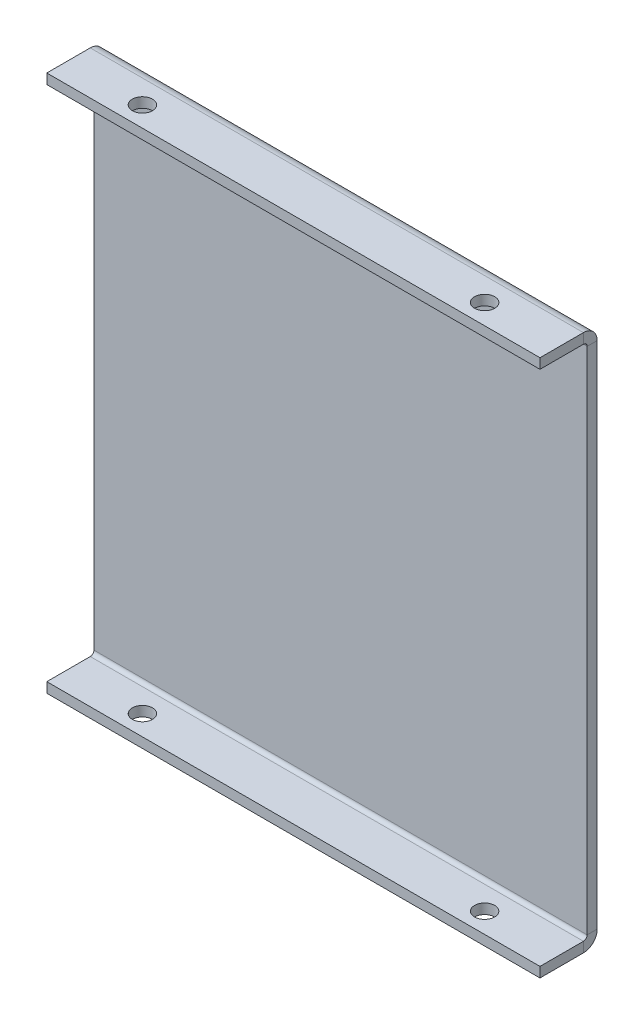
ISO-10303-21;
HEADER;
FILE_DESCRIPTION(('STEP AP214'),'2;1');
FILE_NAME('part.step','',(''),(''),'','','');
FILE_SCHEMA(('AUTOMOTIVE_DESIGN { 1 0 10303 214 1 1 1 1 }'));
ENDSEC;
DATA;
#1=APPLICATION_CONTEXT('core data for automotive mechanical design processes');
#2=APPLICATION_PROTOCOL_DEFINITION('international standard','automotive_design',2000,#1);
#3=PRODUCT_CONTEXT('',#1,'mechanical');
#4=PRODUCT('Part','Part','',(#3));
#5=PRODUCT_RELATED_PRODUCT_CATEGORY('part','',(#4));
#6=PRODUCT_DEFINITION_FORMATION('','',#4);
#7=PRODUCT_DEFINITION_CONTEXT('part definition',#1,'design');
#8=PRODUCT_DEFINITION('design','',#6,#7);
#9=PRODUCT_DEFINITION_SHAPE('','',#8);
#10=(LENGTH_UNIT() NAMED_UNIT(*) SI_UNIT(.MILLI.,.METRE.));
#11=(NAMED_UNIT(*) PLANE_ANGLE_UNIT() SI_UNIT($,.RADIAN.));
#12=(NAMED_UNIT(*) SI_UNIT($,.STERADIAN.) SOLID_ANGLE_UNIT());
#13=UNCERTAINTY_MEASURE_WITH_UNIT(LENGTH_MEASURE(1.E-05),#10,'distance_accuracy_value','');
#14=(GEOMETRIC_REPRESENTATION_CONTEXT(3) GLOBAL_UNCERTAINTY_ASSIGNED_CONTEXT((#13)) GLOBAL_UNIT_ASSIGNED_CONTEXT((#10,
#11,#12)) REPRESENTATION_CONTEXT('',''));
#15=CARTESIAN_POINT('',(0.,0.,0.));
#16=DIRECTION('',(0.,0.,1.));
#17=DIRECTION('',(1.,0.,0.));
#18=AXIS2_PLACEMENT_3D('',#15,#16,#17);
#19=CARTESIAN_POINT('',(-49.,62.,-2.));
#20=DIRECTION('',(0.,0.,1.));
#21=DIRECTION('',(1.,0.,0.));
#22=AXIS2_PLACEMENT_3D('',#19,#20,#21);
#23=PLANE('',#22);
#24=DIRECTION('',(0.,1.,0.));
#25=VECTOR('',#24,1.);
#26=CARTESIAN_POINT('',(49.,62.,-2.));
#27=LINE('',#26,#25);
#28=CARTESIAN_POINT('',(49.,-50.636077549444,-2.));
#29=VERTEX_POINT('',#28);
#30=CARTESIAN_POINT('',(49.,50.636077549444,-2.00000001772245));
#31=VERTEX_POINT('',#30);
#32=EDGE_CURVE('E54',#29,#31,#27,.T.);
#33=ORIENTED_EDGE('',*,*,#32,.F.);
#34=DIRECTION('',(-1.,0.,0.));
#35=VECTOR('',#34,1.);
#36=CARTESIAN_POINT('',(-49.,-50.636077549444,-2.));
#37=LINE('',#36,#35);
#38=CARTESIAN_POINT('',(-49.,-50.636077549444,-2.00000001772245));
#39=VERTEX_POINT('',#38);
#40=EDGE_CURVE('E256',#29,#39,#37,.T.);
#41=ORIENTED_EDGE('',*,*,#40,.T.);
#42=DIRECTION('',(0.,-1.,0.));
#43=VECTOR('',#42,1.);
#44=CARTESIAN_POINT('',(-49.,62.,-2.));
#45=LINE('',#44,#43);
#46=CARTESIAN_POINT('',(-49.,50.636077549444,-2.0000000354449));
#47=VERTEX_POINT('',#46);
#48=EDGE_CURVE('E264',#47,#39,#45,.T.);
#49=ORIENTED_EDGE('',*,*,#48,.F.);
#50=DIRECTION('',(-1.,0.,0.));
#51=VECTOR('',#50,1.);
#52=CARTESIAN_POINT('',(-49.,50.636077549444,-2.));
#53=LINE('',#52,#51);
#54=EDGE_CURVE('E247',#31,#47,#53,.T.);
#55=ORIENTED_EDGE('',*,*,#54,.F.);
#56=EDGE_LOOP('',(#33,#41,#49,#55));
#57=FACE_BOUND('',#56,.T.);
#58=ADVANCED_FACE('F50',(#57),#23,.F.);
#59=CARTESIAN_POINT('',(-49.,62.,-2.));
#60=DIRECTION('',(-1.,0.,0.));
#61=DIRECTION('',(0.,-1.,0.));
#62=AXIS2_PLACEMENT_3D('',#59,#60,#61);
#63=PLANE('',#62);
#64=DIRECTION('',(0.,0.,-1.));
#65=VECTOR('',#64,1.);
#66=CARTESIAN_POINT('',(-49.,-50.636077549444,-2.00000000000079));
#67=LINE('',#66,#65);
#68=CARTESIAN_POINT('',(-49.,-50.636077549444,0.));
#69=VERTEX_POINT('',#68);
#70=EDGE_CURVE('E12',#69,#39,#67,.T.);
#71=ORIENTED_EDGE('',*,*,#70,.F.);
#72=DIRECTION('',(0.,-1.,0.));
#73=VECTOR('',#72,1.);
#74=CARTESIAN_POINT('',(-49.,62.,0.));
#75=LINE('',#74,#73);
#76=CARTESIAN_POINT('',(-49.,50.636077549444,-3.54449022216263E-08));
#77=VERTEX_POINT('',#76);
#78=EDGE_CURVE('E67',#77,#69,#75,.T.);
#79=ORIENTED_EDGE('',*,*,#78,.F.);
#80=DIRECTION('',(0.,0.,-1.));
#81=VECTOR('',#80,1.);
#82=CARTESIAN_POINT('',(-49.,50.636077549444,-2.00000000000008));
#83=LINE('',#82,#81);
#84=EDGE_CURVE('E249',#77,#47,#83,.T.);
#85=ORIENTED_EDGE('',*,*,#84,.T.);
#86=ORIENTED_EDGE('',*,*,#48,.T.);
#87=EDGE_LOOP('',(#71,#79,#85,#86));
#88=FACE_BOUND('',#87,.T.);
#89=ADVANCED_FACE('F52',(#88),#63,.T.);
#90=CARTESIAN_POINT('',(49.,62.,-2.));
#91=DIRECTION('',(1.,0.,0.));
#92=DIRECTION('',(0.,1.,0.));
#93=AXIS2_PLACEMENT_3D('',#90,#91,#92);
#94=PLANE('',#93);
#95=DIRECTION('',(0.,0.,1.));
#96=VECTOR('',#95,1.);
#97=CARTESIAN_POINT('',(49.,-50.636077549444,-2.00000000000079));
#98=LINE('',#97,#96);
#99=CARTESIAN_POINT('',(49.,-50.636077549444,0.));
#100=VERTEX_POINT('',#99);
#101=EDGE_CURVE('E259',#29,#100,#98,.T.);
#102=ORIENTED_EDGE('',*,*,#101,.F.);
#103=ORIENTED_EDGE('',*,*,#32,.T.);
#104=DIRECTION('',(0.,0.,1.));
#105=VECTOR('',#104,1.);
#106=CARTESIAN_POINT('',(49.,50.636077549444,-2.00000000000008));
#107=LINE('',#106,#105);
#108=CARTESIAN_POINT('',(49.,50.636077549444,0.));
#109=VERTEX_POINT('',#108);
#110=EDGE_CURVE('E254',#31,#109,#107,.T.);
#111=ORIENTED_EDGE('',*,*,#110,.T.);
#112=DIRECTION('',(0.,1.,0.));
#113=VECTOR('',#112,1.);
#114=CARTESIAN_POINT('',(49.,62.,0.));
#115=LINE('',#114,#113);
#116=EDGE_CURVE('E75',#100,#109,#115,.T.);
#117=ORIENTED_EDGE('',*,*,#116,.F.);
#118=EDGE_LOOP('',(#102,#103,#111,#117));
#119=FACE_BOUND('',#118,.T.);
#120=ADVANCED_FACE('F269',(#119),#94,.T.);
#121=CARTESIAN_POINT('',(-49.,62.,0.));
#122=DIRECTION('',(0.,0.,1.));
#123=DIRECTION('',(1.,0.,0.));
#124=AXIS2_PLACEMENT_3D('',#121,#122,#123);
#125=PLANE('',#124);
#126=DIRECTION('',(-1.,0.,0.));
#127=VECTOR('',#126,1.);
#128=CARTESIAN_POINT('',(-49.,-50.636077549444,0.));
#129=LINE('',#128,#127);
#130=EDGE_CURVE('E59',#100,#69,#129,.T.);
#131=ORIENTED_EDGE('',*,*,#130,.F.);
#132=ORIENTED_EDGE('',*,*,#116,.T.);
#133=DIRECTION('',(-1.,0.,0.));
#134=VECTOR('',#133,1.);
#135=CARTESIAN_POINT('',(-49.,50.636077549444,0.));
#136=LINE('',#135,#134);
#137=EDGE_CURVE('E252',#109,#77,#136,.T.);
#138=ORIENTED_EDGE('',*,*,#137,.T.);
#139=ORIENTED_EDGE('',*,*,#78,.T.);
#140=EDGE_LOOP('',(#131,#132,#138,#139));
#141=FACE_BOUND('',#140,.T.);
#142=ADVANCED_FACE('F266',(#141),#125,.T.);
#143=CARTESIAN_POINT('',(49.,50.636077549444,0.736600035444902));
#144=DIRECTION('',(1.,0.,0.));
#145=DIRECTION('',(0.,0.,-1.));
#146=AXIS2_PLACEMENT_3D('',#143,#144,#145);
#147=PLANE('',#146);
#148=DIRECTION('',(0.,-1.,0.));
#149=VECTOR('',#148,1.);
#150=CARTESIAN_POINT('',(49.,53.3726775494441,0.736600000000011));
#151=LINE('',#150,#149);
#152=CARTESIAN_POINT('',(49.,53.372677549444,0.736600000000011));
#153=VERTEX_POINT('',#152);
#154=CARTESIAN_POINT('',(49.,51.372677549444,0.73659999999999));
#155=VERTEX_POINT('',#154);
#156=EDGE_CURVE('E193',#153,#155,#151,.T.);
#157=ORIENTED_EDGE('',*,*,#156,.T.);
#158=CARTESIAN_POINT('',(49.,50.636077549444,0.7366));
#159=DIRECTION('',(1.,0.,0.));
#160=DIRECTION('',(0.,0.,-1.));
#161=AXIS2_PLACEMENT_3D('',#158,#159,#160);
#162=CIRCLE('',#161,0.736600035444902);
#163=EDGE_CURVE('E197',#155,#109,#162,.F.);
#164=ORIENTED_EDGE('',*,*,#163,.T.);
#165=ORIENTED_EDGE('',*,*,#110,.F.);
#166=CARTESIAN_POINT('',(49.,50.636077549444,0.736600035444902));
#167=DIRECTION('',(-1.,0.,0.));
#168=DIRECTION('',(0.,0.,-1.));
#169=AXIS2_PLACEMENT_3D('',#166,#167,#168);
#170=CIRCLE('',#169,2.73660005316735);
#171=EDGE_CURVE('E240',#153,#31,#170,.T.);
#172=ORIENTED_EDGE('',*,*,#171,.F.);
#173=EDGE_LOOP('',(#157,#164,#165,#172));
#174=FACE_BOUND('',#173,.T.);
#175=ADVANCED_FACE('F273',(#174),#147,.T.);
#176=CARTESIAN_POINT('',(-49.,50.636077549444,0.736600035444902));
#177=DIRECTION('',(-1.,0.,0.));
#178=DIRECTION('',(0.,0.,1.));
#179=AXIS2_PLACEMENT_3D('',#176,#177,#178);
#180=PLANE('',#179);
#181=ORIENTED_EDGE('',*,*,#84,.F.);
#182=CARTESIAN_POINT('',(-49.,50.636077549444,0.7366));
#183=DIRECTION('',(1.,0.,0.));
#184=DIRECTION('',(0.,0.,-1.));
#185=AXIS2_PLACEMENT_3D('',#182,#183,#184);
#186=CIRCLE('',#185,0.736600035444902);
#187=CARTESIAN_POINT('',(-49.,51.372677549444,0.73659999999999));
#188=VERTEX_POINT('',#187);
#189=EDGE_CURVE('E237',#77,#188,#186,.T.);
#190=ORIENTED_EDGE('',*,*,#189,.T.);
#191=DIRECTION('',(0.,1.,0.));
#192=VECTOR('',#191,1.);
#193=CARTESIAN_POINT('',(-49.,53.3726775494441,0.736600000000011));
#194=LINE('',#193,#192);
#195=CARTESIAN_POINT('',(-49.,53.3726776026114,0.736600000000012));
#196=VERTEX_POINT('',#195);
#197=EDGE_CURVE('E229',#188,#196,#194,.T.);
#198=ORIENTED_EDGE('',*,*,#197,.T.);
#199=CARTESIAN_POINT('',(-49.,50.636077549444,0.736600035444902));
#200=DIRECTION('',(1.,0.,0.));
#201=DIRECTION('',(0.,0.,1.));
#202=AXIS2_PLACEMENT_3D('',#199,#200,#201);
#203=CIRCLE('',#202,2.73660005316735);
#204=EDGE_CURVE('E244',#47,#196,#203,.T.);
#205=ORIENTED_EDGE('',*,*,#204,.F.);
#206=EDGE_LOOP('',(#181,#190,#198,#205));
#207=FACE_BOUND('',#206,.T.);
#208=ADVANCED_FACE('F286',(#207),#180,.T.);
#209=CARTESIAN_POINT('',(-98.0583557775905,50.636077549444,0.7366));
#210=DIRECTION('',(1.,0.,0.));
#211=DIRECTION('',(0.,0.,-1.));
#212=AXIS2_PLACEMENT_3D('',#209,#210,#211);
#213=CYLINDRICAL_SURFACE('',#212,2.7366000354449);
#214=ORIENTED_EDGE('',*,*,#204,.T.);
#215=DIRECTION('',(-1.,0.,0.));
#216=VECTOR('',#215,1.);
#217=CARTESIAN_POINT('',(-49.,53.372677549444,0.736600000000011));
#218=LINE('',#217,#216);
#219=EDGE_CURVE('E209',#153,#196,#218,.T.);
#220=ORIENTED_EDGE('',*,*,#219,.F.);
#221=ORIENTED_EDGE('',*,*,#171,.T.);
#222=ORIENTED_EDGE('',*,*,#54,.T.);
#223=EDGE_LOOP('',(#214,#220,#221,#222));
#224=FACE_BOUND('',#223,.T.);
#225=ADVANCED_FACE('F277',(#224),#213,.T.);
#226=CARTESIAN_POINT('',(-98.0583557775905,50.636077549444,0.7366));
#227=DIRECTION('',(1.,0.,0.));
#228=DIRECTION('',(0.,0.,-1.));
#229=AXIS2_PLACEMENT_3D('',#226,#227,#228);
#230=CYLINDRICAL_SURFACE('',#229,0.736600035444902);
#231=ORIENTED_EDGE('',*,*,#189,.F.);
#232=ORIENTED_EDGE('',*,*,#137,.F.);
#233=ORIENTED_EDGE('',*,*,#163,.F.);
#234=DIRECTION('',(-1.,0.,0.));
#235=VECTOR('',#234,1.);
#236=CARTESIAN_POINT('',(-49.,51.372677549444,0.73659999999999));
#237=LINE('',#236,#235);
#238=EDGE_CURVE('E232',#155,#188,#237,.T.);
#239=ORIENTED_EDGE('',*,*,#238,.T.);
#240=EDGE_LOOP('',(#231,#232,#233,#239));
#241=FACE_BOUND('',#240,.T.);
#242=ADVANCED_FACE('F300',(#241),#230,.F.);
#243=CARTESIAN_POINT('',(-49.,53.372677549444,9.37267754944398));
#244=DIRECTION('',(0.,0.,1.));
#245=DIRECTION('',(-1.,0.,0.));
#246=AXIS2_PLACEMENT_3D('',#243,#244,#245);
#247=PLANE('',#246);
#248=DIRECTION('',(-1.,0.,0.));
#249=VECTOR('',#248,1.);
#250=CARTESIAN_POINT('',(-49.,51.372677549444,9.37267754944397));
#251=LINE('',#250,#249);
#252=CARTESIAN_POINT('',(49.,51.372677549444,9.37267754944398));
#253=VERTEX_POINT('',#252);
#254=CARTESIAN_POINT('',(-49.,51.372677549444,9.37267754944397));
#255=VERTEX_POINT('',#254);
#256=EDGE_CURVE('E202',#253,#255,#251,.T.);
#257=ORIENTED_EDGE('',*,*,#256,.F.);
#258=DIRECTION('',(0.,-1.,0.));
#259=VECTOR('',#258,1.);
#260=CARTESIAN_POINT('',(49.,53.372677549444,9.37267754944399));
#261=LINE('',#260,#259);
#262=CARTESIAN_POINT('',(49.,53.372677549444,9.37267754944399));
#263=VERTEX_POINT('',#262);
#264=EDGE_CURVE('E194',#263,#253,#261,.T.);
#265=ORIENTED_EDGE('',*,*,#264,.F.);
#266=DIRECTION('',(-1.,0.,0.));
#267=VECTOR('',#266,1.);
#268=CARTESIAN_POINT('',(-49.,53.372677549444,9.37267754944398));
#269=LINE('',#268,#267);
#270=CARTESIAN_POINT('',(-49.,53.372677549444,9.37267754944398));
#271=VERTEX_POINT('',#270);
#272=EDGE_CURVE('E226',#263,#271,#269,.T.);
#273=ORIENTED_EDGE('',*,*,#272,.T.);
#274=DIRECTION('',(0.,-1.,0.));
#275=VECTOR('',#274,1.);
#276=CARTESIAN_POINT('',(-49.,53.372677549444,9.37267754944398));
#277=LINE('',#276,#275);
#278=EDGE_CURVE('E224',#271,#255,#277,.T.);
#279=ORIENTED_EDGE('',*,*,#278,.T.);
#280=EDGE_LOOP('',(#257,#265,#273,#279));
#281=FACE_BOUND('',#280,.T.);
#282=ADVANCED_FACE('F294',(#281),#247,.T.);
#283=CARTESIAN_POINT('',(34.,53.372677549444,5.372677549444));
#284=DIRECTION('',(0.,-1.,0.));
#285=DIRECTION('',(1.,0.,0.));
#286=AXIS2_PLACEMENT_3D('',#283,#284,#285);
#287=CYLINDRICAL_SURFACE('',#286,2.);
#288=CARTESIAN_POINT('',(34.,53.372677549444,5.372677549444));
#289=DIRECTION('',(0.,-1.,0.));
#290=DIRECTION('',(1.,0.,0.));
#291=AXIS2_PLACEMENT_3D('',#288,#289,#290);
#292=CIRCLE('',#291,2.);
#293=CARTESIAN_POINT('',(36.,53.372677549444,5.372677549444));
#294=VERTEX_POINT('',#293);
#295=EDGE_CURVE('E212',#294,#294,#292,.T.);
#296=ORIENTED_EDGE('',*,*,#295,.F.);
#297=EDGE_LOOP('',(#296));
#298=FACE_BOUND('',#297,.T.);
#299=CARTESIAN_POINT('',(34.,51.372677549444,5.37267754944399));
#300=DIRECTION('',(0.,-1.,0.));
#301=DIRECTION('',(1.,0.,0.));
#302=AXIS2_PLACEMENT_3D('',#299,#300,#301);
#303=CIRCLE('',#302,2.);
#304=CARTESIAN_POINT('',(36.,51.372677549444,5.37267754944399));
#305=VERTEX_POINT('',#304);
#306=EDGE_CURVE('E221',#305,#305,#303,.T.);
#307=ORIENTED_EDGE('',*,*,#306,.T.);
#308=EDGE_LOOP('',(#307));
#309=FACE_BOUND('',#308,.T.);
#310=ADVANCED_FACE('F359',(#298,#309),#287,.F.);
#311=CARTESIAN_POINT('',(-34.,53.372677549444,5.37267754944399));
#312=DIRECTION('',(0.,-1.,0.));
#313=DIRECTION('',(1.,0.,0.));
#314=AXIS2_PLACEMENT_3D('',#311,#312,#313);
#315=CYLINDRICAL_SURFACE('',#314,2.);
#316=CARTESIAN_POINT('',(-34.,53.372677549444,5.37267754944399));
#317=DIRECTION('',(0.,-1.,0.));
#318=DIRECTION('',(1.,0.,0.));
#319=AXIS2_PLACEMENT_3D('',#316,#317,#318);
#320=CIRCLE('',#319,2.);
#321=CARTESIAN_POINT('',(-32.,53.372677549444,5.37267754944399));
#322=VERTEX_POINT('',#321);
#323=EDGE_CURVE('E215',#322,#322,#320,.T.);
#324=ORIENTED_EDGE('',*,*,#323,.F.);
#325=EDGE_LOOP('',(#324));
#326=FACE_BOUND('',#325,.T.);
#327=CARTESIAN_POINT('',(-34.,51.372677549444,5.37267754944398));
#328=DIRECTION('',(0.,-1.,0.));
#329=DIRECTION('',(1.,0.,0.));
#330=AXIS2_PLACEMENT_3D('',#327,#328,#329);
#331=CIRCLE('',#330,2.);
#332=CARTESIAN_POINT('',(-32.,51.372677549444,5.37267754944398));
#333=VERTEX_POINT('',#332);
#334=EDGE_CURVE('E218',#333,#333,#331,.T.);
#335=ORIENTED_EDGE('',*,*,#334,.T.);
#336=EDGE_LOOP('',(#335));
#337=FACE_BOUND('',#336,.T.);
#338=ADVANCED_FACE('F355',(#326,#337),#315,.F.);
#339=CARTESIAN_POINT('',(-49.,53.372677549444,9.37267754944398));
#340=DIRECTION('',(0.,-1.,0.));
#341=DIRECTION('',(1.,0.,0.));
#342=AXIS2_PLACEMENT_3D('',#339,#340,#341);
#343=PLANE('',#342);
#344=ORIENTED_EDGE('',*,*,#323,.T.);
#345=EDGE_LOOP('',(#344));
#346=FACE_BOUND('',#345,.T.);
#347=ORIENTED_EDGE('',*,*,#295,.T.);
#348=EDGE_LOOP('',(#347));
#349=FACE_BOUND('',#348,.T.);
#350=DIRECTION('',(0.,0.,1.));
#351=VECTOR('',#350,1.);
#352=CARTESIAN_POINT('',(49.,53.372677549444,9.37267754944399));
#353=LINE('',#352,#351);
#354=EDGE_CURVE('E198',#153,#263,#353,.T.);
#355=ORIENTED_EDGE('',*,*,#354,.F.);
#356=ORIENTED_EDGE('',*,*,#219,.T.);
#357=DIRECTION('',(0.,0.,-1.));
#358=VECTOR('',#357,1.);
#359=CARTESIAN_POINT('',(-49.,53.372677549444,9.37267754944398));
#360=LINE('',#359,#358);
#361=EDGE_CURVE('E207',#271,#196,#360,.T.);
#362=ORIENTED_EDGE('',*,*,#361,.F.);
#363=ORIENTED_EDGE('',*,*,#272,.F.);
#364=EDGE_LOOP('',(#355,#356,#362,#363));
#365=FACE_BOUND('',#364,.T.);
#366=ADVANCED_FACE('F281',(#346,#349,#365),#343,.F.);
#367=CARTESIAN_POINT('',(-49.,53.372677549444,9.37267754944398));
#368=DIRECTION('',(-1.,0.,0.));
#369=DIRECTION('',(0.,0.,-1.));
#370=AXIS2_PLACEMENT_3D('',#367,#368,#369);
#371=PLANE('',#370);
#372=ORIENTED_EDGE('',*,*,#197,.F.);
#373=DIRECTION('',(0.,0.,-1.));
#374=VECTOR('',#373,1.);
#375=CARTESIAN_POINT('',(-49.,51.372677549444,9.37267754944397));
#376=LINE('',#375,#374);
#377=EDGE_CURVE('E200',#255,#188,#376,.T.);
#378=ORIENTED_EDGE('',*,*,#377,.F.);
#379=ORIENTED_EDGE('',*,*,#278,.F.);
#380=ORIENTED_EDGE('',*,*,#361,.T.);
#381=EDGE_LOOP('',(#372,#378,#379,#380));
#382=FACE_BOUND('',#381,.T.);
#383=ADVANCED_FACE('F291',(#382),#371,.T.);
#384=CARTESIAN_POINT('',(-49.,51.372677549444,9.37267754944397));
#385=DIRECTION('',(0.,-1.,0.));
#386=DIRECTION('',(1.,0.,0.));
#387=AXIS2_PLACEMENT_3D('',#384,#385,#386);
#388=PLANE('',#387);
#389=ORIENTED_EDGE('',*,*,#238,.F.);
#390=DIRECTION('',(0.,0.,1.));
#391=VECTOR('',#390,1.);
#392=CARTESIAN_POINT('',(49.,51.372677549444,9.37267754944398));
#393=LINE('',#392,#391);
#394=EDGE_CURVE('E205',#155,#253,#393,.T.);
#395=ORIENTED_EDGE('',*,*,#394,.T.);
#396=ORIENTED_EDGE('',*,*,#256,.T.);
#397=ORIENTED_EDGE('',*,*,#377,.T.);
#398=EDGE_LOOP('',(#389,#395,#396,#397));
#399=FACE_BOUND('',#398,.T.);
#400=ORIENTED_EDGE('',*,*,#306,.F.);
#401=EDGE_LOOP('',(#400));
#402=FACE_BOUND('',#401,.T.);
#403=ORIENTED_EDGE('',*,*,#334,.F.);
#404=EDGE_LOOP('',(#403));
#405=FACE_BOUND('',#404,.T.);
#406=ADVANCED_FACE('F347',(#399,#402,#405),#388,.T.);
#407=CARTESIAN_POINT('',(49.,53.372677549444,9.37267754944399));
#408=DIRECTION('',(1.,0.,0.));
#409=DIRECTION('',(0.,0.,1.));
#410=AXIS2_PLACEMENT_3D('',#407,#408,#409);
#411=PLANE('',#410);
#412=ORIENTED_EDGE('',*,*,#156,.F.);
#413=ORIENTED_EDGE('',*,*,#354,.T.);
#414=ORIENTED_EDGE('',*,*,#264,.T.);
#415=ORIENTED_EDGE('',*,*,#394,.F.);
#416=EDGE_LOOP('',(#412,#413,#414,#415));
#417=FACE_BOUND('',#416,.T.);
#418=ADVANCED_FACE('F297',(#417),#411,.T.);
#419=CARTESIAN_POINT('',(49.,-50.636077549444,0.736600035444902));
#420=DIRECTION('',(1.,0.,0.));
#421=DIRECTION('',(0.,0.,-1.));
#422=AXIS2_PLACEMENT_3D('',#419,#420,#421);
#423=PLANE('',#422);
#424=ORIENTED_EDGE('',*,*,#101,.T.);
#425=CARTESIAN_POINT('',(49.,-50.636077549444,0.7366));
#426=DIRECTION('',(-1.,0.,0.));
#427=DIRECTION('',(0.,0.,1.));
#428=AXIS2_PLACEMENT_3D('',#425,#426,#427);
#429=CIRCLE('',#428,0.736600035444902);
#430=CARTESIAN_POINT('',(49.,-51.372677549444,0.736600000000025));
#431=VERTEX_POINT('',#430);
#432=EDGE_CURVE('E161',#100,#431,#429,.T.);
#433=ORIENTED_EDGE('',*,*,#432,.T.);
#434=DIRECTION('',(0.,1.,0.));
#435=VECTOR('',#434,1.);
#436=CARTESIAN_POINT('',(49.,-53.3726775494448,0.736600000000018));
#437=LINE('',#436,#435);
#438=CARTESIAN_POINT('',(49.,-53.372677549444,0.736600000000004));
#439=VERTEX_POINT('',#438);
#440=EDGE_CURVE('E317',#439,#431,#437,.T.);
#441=ORIENTED_EDGE('',*,*,#440,.F.);
#442=CARTESIAN_POINT('',(49.,-50.636077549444,0.736600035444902));
#443=DIRECTION('',(-1.,0.,0.));
#444=DIRECTION('',(0.,0.,-1.));
#445=AXIS2_PLACEMENT_3D('',#442,#443,#444);
#446=CIRCLE('',#445,2.73660005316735);
#447=EDGE_CURVE('E185',#29,#439,#446,.T.);
#448=ORIENTED_EDGE('',*,*,#447,.F.);
#449=EDGE_LOOP('',(#424,#433,#441,#448));
#450=FACE_BOUND('',#449,.T.);
#451=ADVANCED_FACE('F314',(#450),#423,.T.);
#452=CARTESIAN_POINT('',(-49.,-50.636077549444,0.736600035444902));
#453=DIRECTION('',(-1.,0.,0.));
#454=DIRECTION('',(0.,0.,1.));
#455=AXIS2_PLACEMENT_3D('',#452,#453,#454);
#456=PLANE('',#455);
#457=DIRECTION('',(0.,-1.,0.));
#458=VECTOR('',#457,1.);
#459=CARTESIAN_POINT('',(-49.,-53.3726775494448,0.736600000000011));
#460=LINE('',#459,#458);
#461=CARTESIAN_POINT('',(-49.,-51.372677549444,0.736600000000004));
#462=VERTEX_POINT('',#461);
#463=CARTESIAN_POINT('',(-49.,-53.3726775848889,0.736600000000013));
#464=VERTEX_POINT('',#463);
#465=EDGE_CURVE('E150',#462,#464,#460,.T.);
#466=ORIENTED_EDGE('',*,*,#465,.F.);
#467=CARTESIAN_POINT('',(-49.,-50.636077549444,0.7366));
#468=DIRECTION('',(-1.,0.,0.));
#469=DIRECTION('',(0.,0.,1.));
#470=AXIS2_PLACEMENT_3D('',#467,#468,#469);
#471=CIRCLE('',#470,0.736600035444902);
#472=EDGE_CURVE('E182',#462,#69,#471,.F.);
#473=ORIENTED_EDGE('',*,*,#472,.T.);
#474=ORIENTED_EDGE('',*,*,#70,.T.);
#475=CARTESIAN_POINT('',(-49.,-50.636077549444,0.736600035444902));
#476=DIRECTION('',(1.,0.,0.));
#477=DIRECTION('',(0.,0.,1.));
#478=AXIS2_PLACEMENT_3D('',#475,#476,#477);
#479=CIRCLE('',#478,2.73660005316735);
#480=EDGE_CURVE('E190',#464,#39,#479,.T.);
#481=ORIENTED_EDGE('',*,*,#480,.F.);
#482=EDGE_LOOP('',(#466,#473,#474,#481));
#483=FACE_BOUND('',#482,.T.);
#484=ADVANCED_FACE('F305',(#483),#456,.T.);
#485=CARTESIAN_POINT('',(98.0583557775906,-50.636077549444,0.7366));
#486=DIRECTION('',(-1.,0.,0.));
#487=DIRECTION('',(0.,0.,1.));
#488=AXIS2_PLACEMENT_3D('',#485,#486,#487);
#489=CYLINDRICAL_SURFACE('',#488,2.7366000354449);
#490=ORIENTED_EDGE('',*,*,#480,.T.);
#491=ORIENTED_EDGE('',*,*,#40,.F.);
#492=ORIENTED_EDGE('',*,*,#447,.T.);
#493=DIRECTION('',(-1.,0.,0.));
#494=VECTOR('',#493,1.);
#495=CARTESIAN_POINT('',(-49.,-53.372677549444,0.736600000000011));
#496=LINE('',#495,#494);
#497=EDGE_CURVE('E180',#439,#464,#496,.T.);
#498=ORIENTED_EDGE('',*,*,#497,.T.);
#499=EDGE_LOOP('',(#490,#491,#492,#498));
#500=FACE_BOUND('',#499,.T.);
#501=ADVANCED_FACE('F320',(#500),#489,.T.);
#502=CARTESIAN_POINT('',(98.0583557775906,-50.636077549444,0.7366));
#503=DIRECTION('',(-1.,0.,0.));
#504=DIRECTION('',(0.,0.,1.));
#505=AXIS2_PLACEMENT_3D('',#502,#503,#504);
#506=CYLINDRICAL_SURFACE('',#505,0.736600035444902);
#507=ORIENTED_EDGE('',*,*,#472,.F.);
#508=DIRECTION('',(-1.,0.,0.));
#509=VECTOR('',#508,1.);
#510=CARTESIAN_POINT('',(-49.,-51.372677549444,0.736600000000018));
#511=LINE('',#510,#509);
#512=EDGE_CURVE('E311',#431,#462,#511,.T.);
#513=ORIENTED_EDGE('',*,*,#512,.F.);
#514=ORIENTED_EDGE('',*,*,#432,.F.);
#515=ORIENTED_EDGE('',*,*,#130,.T.);
#516=EDGE_LOOP('',(#507,#513,#514,#515));
#517=FACE_BOUND('',#516,.T.);
#518=ADVANCED_FACE('F309',(#517),#506,.F.);
#519=CARTESIAN_POINT('',(34.,-53.3726775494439,5.37267754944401));
#520=DIRECTION('',(0.,1.,0.));
#521=DIRECTION('',(1.,0.,0.));
#522=AXIS2_PLACEMENT_3D('',#519,#520,#521);
#523=CYLINDRICAL_SURFACE('',#522,2.);
#524=CARTESIAN_POINT('',(34.,-53.3726775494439,5.37267754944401));
#525=DIRECTION('',(0.,1.,0.));
#526=DIRECTION('',(1.,0.,0.));
#527=AXIS2_PLACEMENT_3D('',#524,#525,#526);
#528=CIRCLE('',#527,2.);
#529=CARTESIAN_POINT('',(36.,-53.3726775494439,5.37267754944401));
#530=VERTEX_POINT('',#529);
#531=EDGE_CURVE('E400',#530,#530,#528,.T.);
#532=ORIENTED_EDGE('',*,*,#531,.F.);
#533=EDGE_LOOP('',(#532));
#534=FACE_BOUND('',#533,.T.);
#535=CARTESIAN_POINT('',(34.,-51.3726775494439,5.372677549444));
#536=DIRECTION('',(0.,1.,0.));
#537=DIRECTION('',(1.,0.,0.));
#538=AXIS2_PLACEMENT_3D('',#535,#536,#537);
#539=CIRCLE('',#538,2.);
#540=CARTESIAN_POINT('',(36.,-51.3726775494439,5.372677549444));
#541=VERTEX_POINT('',#540);
#542=EDGE_CURVE('E174',#541,#541,#539,.T.);
#543=ORIENTED_EDGE('',*,*,#542,.T.);
#544=EDGE_LOOP('',(#543));
#545=FACE_BOUND('',#544,.T.);
#546=ADVANCED_FACE('F374',(#534,#545),#523,.F.);
#547=CARTESIAN_POINT('',(-34.,-53.3726775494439,5.37267754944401));
#548=DIRECTION('',(0.,1.,0.));
#549=DIRECTION('',(1.,0.,0.));
#550=AXIS2_PLACEMENT_3D('',#547,#548,#549);
#551=CYLINDRICAL_SURFACE('',#550,2.);
#552=CARTESIAN_POINT('',(-34.,-53.3726775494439,5.37267754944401));
#553=DIRECTION('',(0.,1.,0.));
#554=DIRECTION('',(1.,0.,0.));
#555=AXIS2_PLACEMENT_3D('',#552,#553,#554);
#556=CIRCLE('',#555,2.);
#557=CARTESIAN_POINT('',(-32.,-53.3726775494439,5.37267754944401));
#558=VERTEX_POINT('',#557);
#559=EDGE_CURVE('E171',#558,#558,#556,.T.);
#560=ORIENTED_EDGE('',*,*,#559,.F.);
#561=EDGE_LOOP('',(#560));
#562=FACE_BOUND('',#561,.T.);
#563=CARTESIAN_POINT('',(-34.,-51.3726775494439,5.372677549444));
#564=DIRECTION('',(0.,1.,0.));
#565=DIRECTION('',(1.,0.,0.));
#566=AXIS2_PLACEMENT_3D('',#563,#564,#565);
#567=CIRCLE('',#566,2.);
#568=CARTESIAN_POINT('',(-32.,-51.3726775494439,5.372677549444));
#569=VERTEX_POINT('',#568);
#570=EDGE_CURVE('E169',#569,#569,#567,.T.);
#571=ORIENTED_EDGE('',*,*,#570,.T.);
#572=EDGE_LOOP('',(#571));
#573=FACE_BOUND('',#572,.T.);
#574=ADVANCED_FACE('F389',(#562,#573),#551,.F.);
#575=CARTESIAN_POINT('',(-49.,-53.3726775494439,9.37267754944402));
#576=DIRECTION('',(0.,0.,1.));
#577=DIRECTION('',(1.,0.,0.));
#578=AXIS2_PLACEMENT_3D('',#575,#576,#577);
#579=PLANE('',#578);
#580=DIRECTION('',(1.,0.,0.));
#581=VECTOR('',#580,1.);
#582=CARTESIAN_POINT('',(-49.,-51.3726775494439,9.37267754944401));
#583=LINE('',#582,#581);
#584=CARTESIAN_POINT('',(-49.,-51.3726775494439,9.37267754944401));
#585=VERTEX_POINT('',#584);
#586=CARTESIAN_POINT('',(49.,-51.3726775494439,9.372677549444));
#587=VERTEX_POINT('',#586);
#588=EDGE_CURVE('E160',#585,#587,#583,.T.);
#589=ORIENTED_EDGE('',*,*,#588,.F.);
#590=DIRECTION('',(0.,1.,0.));
#591=VECTOR('',#590,1.);
#592=CARTESIAN_POINT('',(-49.,-53.3726775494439,9.37267754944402));
#593=LINE('',#592,#591);
#594=CARTESIAN_POINT('',(-49.,-53.3726775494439,9.37267754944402));
#595=VERTEX_POINT('',#594);
#596=EDGE_CURVE('E147',#595,#585,#593,.T.);
#597=ORIENTED_EDGE('',*,*,#596,.F.);
#598=DIRECTION('',(1.,0.,0.));
#599=VECTOR('',#598,1.);
#600=CARTESIAN_POINT('',(-49.,-53.3726775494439,9.37267754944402));
#601=LINE('',#600,#599);
#602=CARTESIAN_POINT('',(49.,-53.3726775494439,9.37267754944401));
#603=VERTEX_POINT('',#602);
#604=EDGE_CURVE('E158',#595,#603,#601,.T.);
#605=ORIENTED_EDGE('',*,*,#604,.T.);
#606=DIRECTION('',(0.,1.,0.));
#607=VECTOR('',#606,1.);
#608=CARTESIAN_POINT('',(49.,-53.3726775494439,9.37267754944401));
#609=LINE('',#608,#607);
#610=EDGE_CURVE('E168',#603,#587,#609,.T.);
#611=ORIENTED_EDGE('',*,*,#610,.T.);
#612=EDGE_LOOP('',(#589,#597,#605,#611));
#613=FACE_BOUND('',#612,.T.);
#614=ADVANCED_FACE('F157',(#613),#579,.T.);
#615=CARTESIAN_POINT('',(-49.,-53.3726775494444,-114.627322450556));
#616=DIRECTION('',(0.,1.,0.));
#617=DIRECTION('',(1.,0.,0.));
#618=AXIS2_PLACEMENT_3D('',#615,#616,#617);
#619=PLANE('',#618);
#620=ORIENTED_EDGE('',*,*,#497,.F.);
#621=DIRECTION('',(0.,0.,-1.));
#622=VECTOR('',#621,1.);
#623=CARTESIAN_POINT('',(49.,-53.3726775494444,-114.627322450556));
#624=LINE('',#623,#622);
#625=EDGE_CURVE('E167',#603,#439,#624,.T.);
#626=ORIENTED_EDGE('',*,*,#625,.F.);
#627=ORIENTED_EDGE('',*,*,#604,.F.);
#628=DIRECTION('',(0.,0.,1.));
#629=VECTOR('',#628,1.);
#630=CARTESIAN_POINT('',(-49.,-53.3726775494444,-114.627322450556));
#631=LINE('',#630,#629);
#632=EDGE_CURVE('E144',#464,#595,#631,.T.);
#633=ORIENTED_EDGE('',*,*,#632,.F.);
#634=EDGE_LOOP('',(#620,#626,#627,#633));
#635=FACE_BOUND('',#634,.T.);
#636=ORIENTED_EDGE('',*,*,#559,.T.);
#637=EDGE_LOOP('',(#636));
#638=FACE_BOUND('',#637,.T.);
#639=ORIENTED_EDGE('',*,*,#531,.T.);
#640=EDGE_LOOP('',(#639));
#641=FACE_BOUND('',#640,.T.);
#642=ADVANCED_FACE('F164',(#635,#638,#641),#619,.F.);
#643=CARTESIAN_POINT('',(49.,-53.3726775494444,-114.627322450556));
#644=DIRECTION('',(1.,0.,0.));
#645=DIRECTION('',(0.,0.,-1.));
#646=AXIS2_PLACEMENT_3D('',#643,#644,#645);
#647=PLANE('',#646);
#648=ORIENTED_EDGE('',*,*,#625,.T.);
#649=ORIENTED_EDGE('',*,*,#440,.T.);
#650=DIRECTION('',(0.,0.,-1.));
#651=VECTOR('',#650,1.);
#652=CARTESIAN_POINT('',(49.,-51.3726775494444,-114.627322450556));
#653=LINE('',#652,#651);
#654=EDGE_CURVE('E405',#587,#431,#653,.T.);
#655=ORIENTED_EDGE('',*,*,#654,.F.);
#656=ORIENTED_EDGE('',*,*,#610,.F.);
#657=EDGE_LOOP('',(#648,#649,#655,#656));
#658=FACE_BOUND('',#657,.T.);
#659=ADVANCED_FACE('F380',(#658),#647,.T.);
#660=CARTESIAN_POINT('',(-49.,-51.3726775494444,-114.627322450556));
#661=DIRECTION('',(0.,1.,0.));
#662=DIRECTION('',(1.,0.,0.));
#663=AXIS2_PLACEMENT_3D('',#660,#661,#662);
#664=PLANE('',#663);
#665=ORIENTED_EDGE('',*,*,#570,.F.);
#666=EDGE_LOOP('',(#665));
#667=FACE_BOUND('',#666,.T.);
#668=ORIENTED_EDGE('',*,*,#542,.F.);
#669=EDGE_LOOP('',(#668));
#670=FACE_BOUND('',#669,.T.);
#671=ORIENTED_EDGE('',*,*,#654,.T.);
#672=ORIENTED_EDGE('',*,*,#512,.T.);
#673=DIRECTION('',(0.,0.,1.));
#674=VECTOR('',#673,1.);
#675=CARTESIAN_POINT('',(-49.,-51.3726775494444,-114.627322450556));
#676=LINE('',#675,#674);
#677=EDGE_CURVE('E417',#462,#585,#676,.T.);
#678=ORIENTED_EDGE('',*,*,#677,.T.);
#679=ORIENTED_EDGE('',*,*,#588,.T.);
#680=EDGE_LOOP('',(#671,#672,#678,#679));
#681=FACE_BOUND('',#680,.T.);
#682=ADVANCED_FACE('F377',(#667,#670,#681),#664,.T.);
#683=CARTESIAN_POINT('',(-49.,-53.3726775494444,-114.627322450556));
#684=DIRECTION('',(-1.,0.,0.));
#685=DIRECTION('',(0.,0.,1.));
#686=AXIS2_PLACEMENT_3D('',#683,#684,#685);
#687=PLANE('',#686);
#688=ORIENTED_EDGE('',*,*,#677,.F.);
#689=ORIENTED_EDGE('',*,*,#465,.T.);
#690=ORIENTED_EDGE('',*,*,#632,.T.);
#691=ORIENTED_EDGE('',*,*,#596,.T.);
#692=EDGE_LOOP('',(#688,#689,#690,#691));
#693=FACE_BOUND('',#692,.T.);
#694=ADVANCED_FACE('F146',(#693),#687,.T.);
#695=CLOSED_SHELL('',(#58,#89,#120,#142,#175,#208,#225,#242,#282,#310,#338,#366,#383,#406,#418,
#451,#484,#501,#518,#546,#574,#614,#642,#659,#682,#694));
#696=MANIFOLD_SOLID_BREP('B2',#695);
#697=ADVANCED_BREP_SHAPE_REPRESENTATION('',(#18,#696),#14);
#698=SHAPE_DEFINITION_REPRESENTATION(#9,#697);
ENDSEC;
END-ISO-10303-21;
